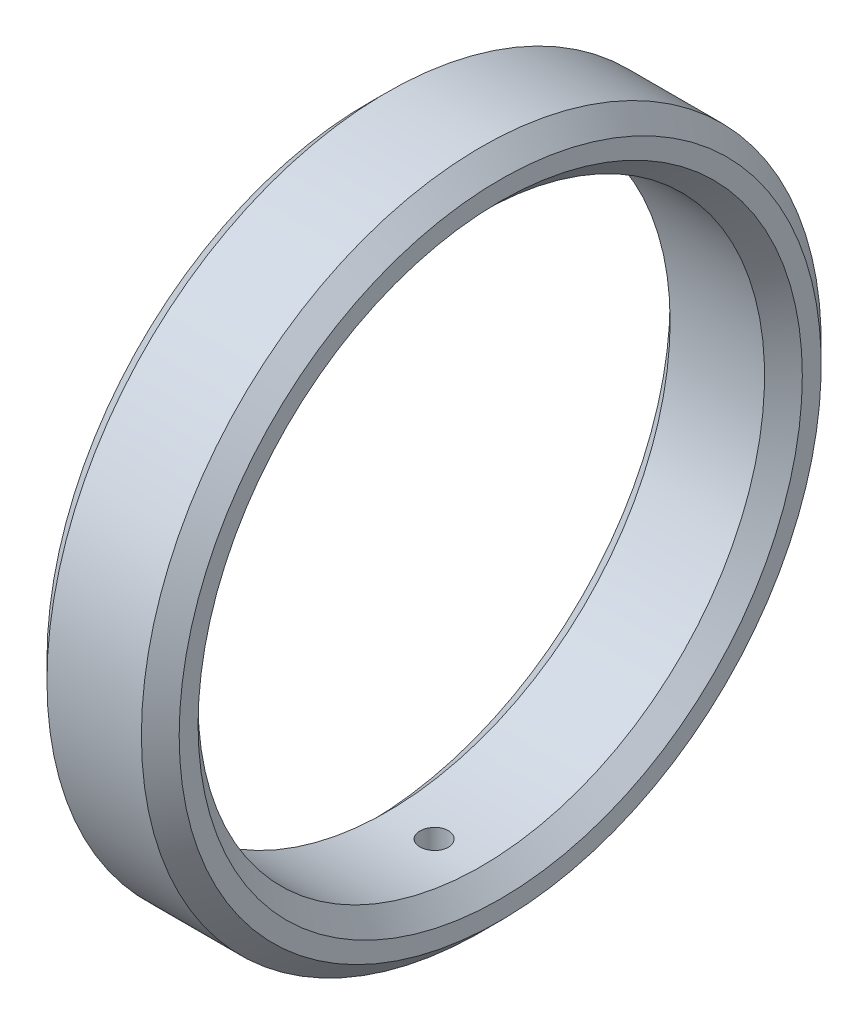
ISO-10303-21;
HEADER;
FILE_DESCRIPTION(('STEP AP214'),'2;1');
FILE_NAME('part.step','',(''),(''),'','','');
FILE_SCHEMA(('AUTOMOTIVE_DESIGN { 1 0 10303 214 1 1 1 1 }'));
ENDSEC;
DATA;
#1=APPLICATION_CONTEXT('core data for automotive mechanical design processes');
#2=APPLICATION_PROTOCOL_DEFINITION('international standard','automotive_design',2000,#1);
#3=PRODUCT_CONTEXT('',#1,'mechanical');
#4=PRODUCT('Part','Part','',(#3));
#5=PRODUCT_RELATED_PRODUCT_CATEGORY('part','',(#4));
#6=PRODUCT_DEFINITION_FORMATION('','',#4);
#7=PRODUCT_DEFINITION_CONTEXT('part definition',#1,'design');
#8=PRODUCT_DEFINITION('design','',#6,#7);
#9=PRODUCT_DEFINITION_SHAPE('','',#8);
#10=(LENGTH_UNIT() NAMED_UNIT(*) SI_UNIT(.MILLI.,.METRE.));
#11=(NAMED_UNIT(*) PLANE_ANGLE_UNIT() SI_UNIT($,.RADIAN.));
#12=(NAMED_UNIT(*) SI_UNIT($,.STERADIAN.) SOLID_ANGLE_UNIT());
#13=UNCERTAINTY_MEASURE_WITH_UNIT(LENGTH_MEASURE(1.E-05),#10,'distance_accuracy_value','');
#14=(GEOMETRIC_REPRESENTATION_CONTEXT(3) GLOBAL_UNCERTAINTY_ASSIGNED_CONTEXT((#13)) GLOBAL_UNIT_ASSIGNED_CONTEXT((#10,
#11,#12)) REPRESENTATION_CONTEXT('',''));
#15=CARTESIAN_POINT('',(0.,0.,0.));
#16=DIRECTION('',(0.,0.,1.));
#17=DIRECTION('',(1.,0.,0.));
#18=AXIS2_PLACEMENT_3D('',#15,#16,#17);
#19=CARTESIAN_POINT('',(-17.9946864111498,0.,0.));
#20=DIRECTION('',(1.,0.,0.));
#21=DIRECTION('',(0.,0.,-1.));
#22=AXIS2_PLACEMENT_3D('',#19,#20,#21);
#23=CONICAL_SURFACE('',#22,18.,0.785398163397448);
#24=CARTESIAN_POINT('',(-18.9946864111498,0.,0.));
#25=DIRECTION('',(-1.,0.,0.));
#26=DIRECTION('',(0.,0.,1.));
#27=AXIS2_PLACEMENT_3D('',#24,#25,#26);
#28=CIRCLE('',#27,17.);
#29=CARTESIAN_POINT('',(-18.9946864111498,0.,17.));
#30=VERTEX_POINT('',#29);
#31=EDGE_CURVE('E66',#30,#30,#28,.T.);
#32=ORIENTED_EDGE('',*,*,#31,.F.);
#33=EDGE_LOOP('',(#32));
#34=FACE_BOUND('',#33,.T.);
#35=CARTESIAN_POINT('',(-17.9946864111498,0.,0.));
#36=DIRECTION('',(-1.,0.,0.));
#37=DIRECTION('',(0.,0.,1.));
#38=AXIS2_PLACEMENT_3D('',#35,#36,#37);
#39=CIRCLE('',#38,18.);
#40=CARTESIAN_POINT('',(-17.9946864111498,0.,18.));
#41=VERTEX_POINT('',#40);
#42=EDGE_CURVE('E57',#41,#41,#39,.T.);
#43=ORIENTED_EDGE('',*,*,#42,.T.);
#44=EDGE_LOOP('',(#43));
#45=FACE_BOUND('',#44,.T.);
#46=ADVANCED_FACE('F33',(#34,#45),#23,.T.);
#47=CARTESIAN_POINT('',(-47.2046167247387,0.,0.));
#48=DIRECTION('',(-1.,0.,0.));
#49=DIRECTION('',(0.,0.,1.));
#50=AXIS2_PLACEMENT_3D('',#47,#48,#49);
#51=CYLINDRICAL_SURFACE('',#50,18.);
#52=CARTESIAN_POINT('',(-15.4946864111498,-17.9843682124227,0.75));
#53=CARTESIAN_POINT('',(-15.452578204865,-17.9843684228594,0.749998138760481));
#54=CARTESIAN_POINT('',(-15.4104399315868,-17.9845176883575,0.746441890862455));
#55=CARTESIAN_POINT('',(-15.3273252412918,-17.9850987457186,0.732305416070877));
#56=CARTESIAN_POINT('',(-15.286350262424,-17.9855308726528,0.721716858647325));
#57=CARTESIAN_POINT('',(-15.206778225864,-17.986628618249,0.69381892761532));
#58=CARTESIAN_POINT('',(-15.1681799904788,-17.9872941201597,0.67651291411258));
#59=CARTESIAN_POINT('',(-15.0944470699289,-17.9887834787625,0.635676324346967));
#60=CARTESIAN_POINT('',(-15.0593115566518,-17.9896072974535,0.612147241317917));
#61=CARTESIAN_POINT('',(-14.9934645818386,-17.9913211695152,0.559512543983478));
#62=CARTESIAN_POINT('',(-14.9627559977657,-17.9922112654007,0.530403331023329));
#63=CARTESIAN_POINT('',(-14.9066590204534,-17.9939569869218,0.467441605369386));
#64=CARTESIAN_POINT('',(-14.8812708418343,-17.9948126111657,0.433588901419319));
#65=CARTESIAN_POINT('',(-14.8365284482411,-17.9963932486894,0.362087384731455));
#66=CARTESIAN_POINT('',(-14.8171763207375,-17.9971182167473,0.32443726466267));
#67=CARTESIAN_POINT('',(-14.785068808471,-17.9983554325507,0.246418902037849));
#68=CARTESIAN_POINT('',(-14.772313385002,-17.9988676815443,0.206050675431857));
#69=CARTESIAN_POINT('',(-14.7537685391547,-17.9996214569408,0.123767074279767));
#70=CARTESIAN_POINT('',(-14.7479750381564,-17.9998631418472,0.0818526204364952));
#71=CARTESIAN_POINT('',(-14.7435059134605,-18.0000490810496,-0.00235454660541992));
#72=CARTESIAN_POINT('',(-14.7448302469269,-17.9999933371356,-0.0446472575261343));
#73=CARTESIAN_POINT('',(-14.7545557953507,-17.9995908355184,-0.128382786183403));
#74=CARTESIAN_POINT('',(-14.7629526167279,-17.9992442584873,-0.169826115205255));
#75=CARTESIAN_POINT('',(-14.7865779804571,-17.9982993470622,-0.25071444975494));
#76=CARTESIAN_POINT('',(-14.8018065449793,-17.9977010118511,-0.290159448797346));
#77=CARTESIAN_POINT('',(-14.8386681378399,-17.9963196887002,-0.36594558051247));
#78=CARTESIAN_POINT('',(-14.8603031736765,-17.995536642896,-0.402285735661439));
#79=CARTESIAN_POINT('',(-14.9093620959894,-17.99387411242,-0.470819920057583));
#80=CARTESIAN_POINT('',(-14.9367860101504,-17.992994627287,-0.503013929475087));
#81=CARTESIAN_POINT('',(-14.9966690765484,-17.991237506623,-0.562367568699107));
#82=CARTESIAN_POINT('',(-15.0291320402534,-17.990359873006,-0.589523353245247));
#83=CARTESIAN_POINT('',(-15.0981582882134,-17.988706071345,-0.638000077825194));
#84=CARTESIAN_POINT('',(-15.1347215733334,-17.9879299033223,-0.659321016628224));
#85=CARTESIAN_POINT('',(-15.2109128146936,-17.9865666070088,-0.695522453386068));
#86=CARTESIAN_POINT('',(-15.2505408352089,-17.985979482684,-0.710402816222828));
#87=CARTESIAN_POINT('',(-15.3317356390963,-17.9850606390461,-0.733298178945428));
#88=CARTESIAN_POINT('',(-15.373302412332,-17.984728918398,-0.741313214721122));
#89=CARTESIAN_POINT('',(-15.4571613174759,-17.9843585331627,-0.750245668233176));
#90=CARTESIAN_POINT('',(-15.499452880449,-17.9843196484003,-0.751168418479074));
#91=CARTESIAN_POINT('',(-15.5835902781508,-17.9845387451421,-0.745904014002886));
#92=CARTESIAN_POINT('',(-15.6254361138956,-17.9847967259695,-0.739716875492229));
#93=CARTESIAN_POINT('',(-15.707479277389,-17.9855802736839,-0.72041274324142));
#94=CARTESIAN_POINT('',(-15.7476771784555,-17.9861057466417,-0.707298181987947));
#95=CARTESIAN_POINT('',(-15.8253010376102,-17.9873649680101,-0.674513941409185));
#96=CARTESIAN_POINT('',(-15.8627269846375,-17.9880987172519,-0.654844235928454));
#97=CARTESIAN_POINT('',(-15.9337690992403,-17.9896923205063,-0.609494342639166));
#98=CARTESIAN_POINT('',(-15.9673829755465,-17.9905522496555,-0.583810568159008));
#99=CARTESIAN_POINT('',(-16.0298237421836,-17.9923010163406,-0.52716685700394));
#100=CARTESIAN_POINT('',(-16.0586506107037,-17.9931898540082,-0.496206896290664));
#101=CARTESIAN_POINT('',(-16.1107169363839,-17.9948968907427,-0.42986677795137));
#102=CARTESIAN_POINT('',(-16.133952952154,-17.9957150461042,-0.394483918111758));
#103=CARTESIAN_POINT('',(-16.1741544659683,-17.9971878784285,-0.320316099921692));
#104=CARTESIAN_POINT('',(-16.1911199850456,-17.9978425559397,-0.281531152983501));
#105=CARTESIAN_POINT('',(-16.2182928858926,-17.998914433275,-0.201673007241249));
#106=CARTESIAN_POINT('',(-16.2285024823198,-17.9993317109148,-0.160600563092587));
#107=CARTESIAN_POINT('',(-16.2418809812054,-17.9998820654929,-0.077322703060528));
#108=CARTESIAN_POINT('',(-16.2450499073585,-18.0000151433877,-0.0351172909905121));
#109=CARTESIAN_POINT('',(-16.2442568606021,-17.9999821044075,0.0491942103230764));
#110=CARTESIAN_POINT('',(-16.2403002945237,-17.9998162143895,0.0913003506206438));
#111=CARTESIAN_POINT('',(-16.2253797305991,-17.9992043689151,0.174250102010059));
#112=CARTESIAN_POINT('',(-16.2144157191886,-17.9987584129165,0.215093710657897));
#113=CARTESIAN_POINT('',(-16.1857924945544,-17.9976366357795,0.294360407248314));
#114=CARTESIAN_POINT('',(-16.1681331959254,-17.9969608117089,0.332783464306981));
#115=CARTESIAN_POINT('',(-16.1266218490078,-17.9954553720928,0.40611927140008));
#116=CARTESIAN_POINT('',(-16.1027700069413,-17.9946257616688,0.441032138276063));
#117=CARTESIAN_POINT('',(-16.0495321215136,-17.9929054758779,0.506382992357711));
#118=CARTESIAN_POINT('',(-16.0201424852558,-17.9920147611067,0.536818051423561));
#119=CARTESIAN_POINT('',(-15.9566623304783,-17.9902728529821,0.59233121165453));
#120=CARTESIAN_POINT('',(-15.9225706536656,-17.9894216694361,0.617407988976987));
#121=CARTESIAN_POINT('',(-15.8506338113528,-17.9878543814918,0.661500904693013));
#122=CARTESIAN_POINT('',(-15.812785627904,-17.9871383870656,0.680512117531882));
#123=CARTESIAN_POINT('',(-15.734460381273,-17.985924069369,0.711887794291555));
#124=CARTESIAN_POINT('',(-15.6939865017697,-17.9854254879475,0.724260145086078));
#125=CARTESIAN_POINT('',(-15.6268303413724,-17.9848348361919,0.738745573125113));
#126=CARTESIAN_POINT('',(-15.6005834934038,-17.9846606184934,0.742960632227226));
#127=CARTESIAN_POINT('',(-15.5477905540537,-17.9844272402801,0.748588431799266));
#128=CARTESIAN_POINT('',(-15.5212444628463,-17.9843680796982,0.75000117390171));
#129=CARTESIAN_POINT('',(-15.4946864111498,-17.9843682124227,0.75));
#130=B_SPLINE_CURVE_WITH_KNOTS('',3,(#52,#53,#54,#55,#56,#57,#58,#59,#60,#61,#62,#63,#64,#65,
#66,#67,#68,#69,#70,#71,#72,#73,#74,#75,#76,#77,#78,#79,#80,#81,#82,#83,#84,#85,#86,#87,#88,#89,
#90,#91,#92,#93,#94,#95,#96,#97,#98,#99,#100,#101,#102,#103,#104,#105,#106,#107,#108,#109,#110,
#111,#112,#113,#114,#115,#116,#117,#118,#119,#120,#121,#122,#123,#124,#125,#126,#127,#128,#129),
.UNSPECIFIED.,.T.,.F.,(4,2,2,2,2,2,2,2,2,2,2,2,2,2,2,2,2,2,2,2,2,2,2,2,2,2,2,2,2,2,2,2,2,2,2,2,
2,2,4),(0.,0.126227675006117,0.252605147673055,0.378919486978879,0.505203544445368,
0.631569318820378,0.75794018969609,0.884354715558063,1.01076849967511,1.13710818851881,
1.26344711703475,1.38970761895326,1.51596853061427,1.64226904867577,1.76857017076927,
1.89496729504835,2.02136444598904,2.14776424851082,2.27416339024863,2.40046748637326,
2.52677129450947,2.65303078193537,2.77929077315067,2.90562625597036,3.03196231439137,
3.15837593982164,3.28478914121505,3.41116088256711,3.53753219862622,3.66380766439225,
3.79008337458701,3.91636069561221,4.04263381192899,4.16898913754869,4.29537564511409,
4.42186452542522,4.54820280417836,4.62781586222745,4.70742887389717),.UNSPECIFIED.);
#131=CARTESIAN_POINT('',(-15.4946864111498,-17.9843682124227,0.75));
#132=VERTEX_POINT('',#131);
#133=EDGE_CURVE('E69',#132,#132,#130,.T.);
#134=ORIENTED_EDGE('',*,*,#133,.T.);
#135=EDGE_LOOP('',(#134));
#136=FACE_BOUND('',#135,.T.);
#137=ORIENTED_EDGE('',*,*,#42,.F.);
#138=EDGE_LOOP('',(#137));
#139=FACE_BOUND('',#138,.T.);
#140=CARTESIAN_POINT('',(-12.9946864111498,0.,0.));
#141=DIRECTION('',(-1.,0.,0.));
#142=DIRECTION('',(0.,0.,1.));
#143=AXIS2_PLACEMENT_3D('',#140,#141,#142);
#144=CIRCLE('',#143,18.);
#145=CARTESIAN_POINT('',(-12.9946864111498,0.,18.));
#146=VERTEX_POINT('',#145);
#147=EDGE_CURVE('E60',#146,#146,#144,.T.);
#148=ORIENTED_EDGE('',*,*,#147,.T.);
#149=EDGE_LOOP('',(#148));
#150=FACE_BOUND('',#149,.T.);
#151=ADVANCED_FACE('F74',(#136,#139,#150),#51,.T.);
#152=CARTESIAN_POINT('',(-11.9946864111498,0.,0.));
#153=DIRECTION('',(-1.,0.,0.));
#154=DIRECTION('',(0.,0.,1.));
#155=AXIS2_PLACEMENT_3D('',#152,#153,#154);
#156=CONICAL_SURFACE('',#155,17.,0.785398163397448);
#157=ORIENTED_EDGE('',*,*,#147,.F.);
#158=EDGE_LOOP('',(#157));
#159=FACE_BOUND('',#158,.T.);
#160=CARTESIAN_POINT('',(-11.9946864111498,0.,0.));
#161=DIRECTION('',(-1.,0.,0.));
#162=DIRECTION('',(0.,0.,1.));
#163=AXIS2_PLACEMENT_3D('',#160,#161,#162);
#164=CIRCLE('',#163,17.);
#165=CARTESIAN_POINT('',(-11.9946864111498,0.,17.));
#166=VERTEX_POINT('',#165);
#167=EDGE_CURVE('E63',#166,#166,#164,.T.);
#168=ORIENTED_EDGE('',*,*,#167,.T.);
#169=EDGE_LOOP('',(#168));
#170=FACE_BOUND('',#169,.T.);
#171=ADVANCED_FACE('F101',(#159,#170),#156,.T.);
#172=CARTESIAN_POINT('',(-11.9946864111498,17.,0.));
#173=DIRECTION('',(-1.,0.,0.));
#174=DIRECTION('',(0.,0.,1.));
#175=AXIS2_PLACEMENT_3D('',#172,#173,#174);
#176=PLANE('',#175);
#177=CARTESIAN_POINT('',(-11.9946864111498,0.,0.));
#178=DIRECTION('',(-1.,0.,0.));
#179=DIRECTION('',(0.,0.,1.));
#180=AXIS2_PLACEMENT_3D('',#177,#178,#179);
#181=CIRCLE('',#180,16.);
#182=CARTESIAN_POINT('',(-11.9946864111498,0.,16.));
#183=VERTEX_POINT('',#182);
#184=EDGE_CURVE('E10',#183,#183,#181,.T.);
#185=ORIENTED_EDGE('',*,*,#184,.T.);
#186=EDGE_LOOP('',(#185));
#187=FACE_BOUND('',#186,.T.);
#188=ORIENTED_EDGE('',*,*,#167,.F.);
#189=EDGE_LOOP('',(#188));
#190=FACE_BOUND('',#189,.T.);
#191=ADVANCED_FACE('F98',(#187,#190),#176,.F.);
#192=CARTESIAN_POINT('',(-18.9946864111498,17.,0.));
#193=DIRECTION('',(1.,0.,0.));
#194=DIRECTION('',(0.,0.,-1.));
#195=AXIS2_PLACEMENT_3D('',#192,#193,#194);
#196=PLANE('',#195);
#197=CARTESIAN_POINT('',(-18.9946864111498,0.,0.));
#198=DIRECTION('',(1.,0.,0.));
#199=DIRECTION('',(0.,0.,-1.));
#200=AXIS2_PLACEMENT_3D('',#197,#198,#199);
#201=CIRCLE('',#200,16.);
#202=CARTESIAN_POINT('',(-18.9946864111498,0.,-16.));
#203=VERTEX_POINT('',#202);
#204=EDGE_CURVE('E45',#203,#203,#201,.T.);
#205=ORIENTED_EDGE('',*,*,#204,.T.);
#206=EDGE_LOOP('',(#205));
#207=FACE_BOUND('',#206,.T.);
#208=ORIENTED_EDGE('',*,*,#31,.T.);
#209=EDGE_LOOP('',(#208));
#210=FACE_BOUND('',#209,.T.);
#211=ADVANCED_FACE('F94',(#207,#210),#196,.F.);
#212=CARTESIAN_POINT('',(-11.9946864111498,0.,0.));
#213=DIRECTION('',(-1.,0.,0.));
#214=DIRECTION('',(0.,0.,1.));
#215=AXIS2_PLACEMENT_3D('',#212,#213,#214);
#216=CYLINDRICAL_SURFACE('',#215,15.);
#217=CARTESIAN_POINT('',(-15.4946864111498,-14.9812382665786,0.75));
#218=CARTESIAN_POINT('',(-15.5367859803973,-14.9812385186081,0.749998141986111));
#219=CARTESIAN_POINT('',(-15.578915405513,-14.981417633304,0.746443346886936));
#220=CARTESIAN_POINT('',(-15.6620120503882,-14.9821148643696,0.732312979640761));
#221=CARTESIAN_POINT('',(-15.7029778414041,-14.9826333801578,0.721729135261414));
#222=CARTESIAN_POINT('',(-15.7825314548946,-14.9839505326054,0.693844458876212));
#223=CARTESIAN_POINT('',(-15.8211204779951,-14.9847490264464,0.676547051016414));
#224=CARTESIAN_POINT('',(-15.8948367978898,-14.9865359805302,0.6357315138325));
#225=CARTESIAN_POINT('',(-15.9299649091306,-14.987524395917,0.612214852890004));
#226=CARTESIAN_POINT('',(-15.9958082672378,-14.9895809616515,0.559601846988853));
#227=CARTESIAN_POINT('',(-16.0265195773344,-14.9906491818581,0.530500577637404));
#228=CARTESIAN_POINT('',(-16.0826239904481,-14.9927443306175,0.467554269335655));
#229=CARTESIAN_POINT('',(-16.1080168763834,-14.9937712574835,0.433709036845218));
#230=CARTESIAN_POINT('',(-16.1527744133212,-14.9956686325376,0.362215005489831));
#231=CARTESIAN_POINT('',(-16.1721360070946,-14.9965390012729,0.324564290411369));
#232=CARTESIAN_POINT('',(-16.2042617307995,-14.9980244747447,0.246541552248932));
#233=CARTESIAN_POINT('',(-16.2170259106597,-14.9986395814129,0.206169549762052));
#234=CARTESIAN_POINT('',(-16.2355841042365,-14.9995447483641,0.123886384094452));
#235=CARTESIAN_POINT('',(-16.2413839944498,-14.9998350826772,0.0819765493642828));
#236=CARTESIAN_POINT('',(-16.2458671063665,-15.0000589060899,-0.00222278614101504));
#237=CARTESIAN_POINT('',(-16.2445503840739,-14.9999923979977,-0.0445122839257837));
#238=CARTESIAN_POINT('',(-16.2348425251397,-14.9995102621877,-0.12823071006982));
#239=CARTESIAN_POINT('',(-16.2264577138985,-14.9990949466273,-0.169660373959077));
#240=CARTESIAN_POINT('',(-16.2028614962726,-14.9979623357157,-0.250523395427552));
#241=CARTESIAN_POINT('',(-16.1876500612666,-14.9972450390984,-0.289956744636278));
#242=CARTESIAN_POINT('',(-16.1508251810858,-14.9955887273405,-0.365728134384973));
#243=CARTESIAN_POINT('',(-16.1292088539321,-14.9946496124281,-0.402064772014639));
#244=CARTESIAN_POINT('',(-16.080189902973,-14.9926554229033,-0.470595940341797));
#245=CARTESIAN_POINT('',(-16.0527872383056,-14.9916003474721,-0.502790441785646));
#246=CARTESIAN_POINT('',(-15.9929377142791,-14.9894916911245,-0.562160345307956));
#247=CARTESIAN_POINT('',(-15.9604853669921,-14.9884381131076,-0.589330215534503));
#248=CARTESIAN_POINT('',(-15.8914769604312,-14.9864523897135,-0.637836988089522));
#249=CARTESIAN_POINT('',(-15.8549209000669,-14.9855202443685,-0.659173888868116));
#250=CARTESIAN_POINT('',(-15.778739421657,-14.983882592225,-0.695408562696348));
#251=CARTESIAN_POINT('',(-15.7391139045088,-14.983177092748,-0.710306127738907));
#252=CARTESIAN_POINT('',(-15.6579198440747,-14.9820725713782,-0.733235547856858));
#253=CARTESIAN_POINT('',(-15.6163513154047,-14.9816735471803,-0.741267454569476));
#254=CARTESIAN_POINT('',(-15.5324993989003,-14.9812274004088,-0.750230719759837));
#255=CARTESIAN_POINT('',(-15.4902168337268,-14.9811798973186,-0.75116975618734));
#256=CARTESIAN_POINT('',(-15.4060947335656,-14.9814411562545,-0.745940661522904));
#257=CARTESIAN_POINT('',(-15.3642551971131,-14.9817499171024,-0.739772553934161));
#258=CARTESIAN_POINT('',(-15.2822283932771,-14.9826885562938,-0.720510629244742));
#259=CARTESIAN_POINT('',(-15.2420402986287,-14.9833182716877,-0.707420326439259));
#260=CARTESIAN_POINT('',(-15.1644316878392,-14.9848277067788,-0.674689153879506));
#261=CARTESIAN_POINT('',(-15.1270111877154,-14.9857074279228,-0.655048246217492));
#262=CARTESIAN_POINT('',(-15.0559646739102,-14.987618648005,-0.609753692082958));
#263=CARTESIAN_POINT('',(-15.0223419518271,-14.9886502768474,-0.58409488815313));
#264=CARTESIAN_POINT('',(-14.9598785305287,-14.990748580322,-0.527500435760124));
#265=CARTESIAN_POINT('',(-14.9310378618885,-14.9918152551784,-0.496564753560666));
#266=CARTESIAN_POINT('',(-14.8789314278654,-14.9938645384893,-0.430261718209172));
#267=CARTESIAN_POINT('',(-14.8556706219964,-14.9948470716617,-0.394890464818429));
#268=CARTESIAN_POINT('',(-14.8154181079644,-14.9966162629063,-0.3207400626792));
#269=CARTESIAN_POINT('',(-14.7984263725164,-14.997402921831,-0.281960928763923));
#270=CARTESIAN_POINT('',(-14.7712030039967,-14.9986913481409,-0.202114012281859));
#271=CARTESIAN_POINT('',(-14.7609681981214,-14.9991932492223,-0.161047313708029));
#272=CARTESIAN_POINT('',(-14.7475388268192,-14.9998561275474,-0.0777758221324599));
#273=CARTESIAN_POINT('',(-14.7443442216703,-15.0000171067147,-0.0355710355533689));
#274=CARTESIAN_POINT('',(-14.7450863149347,-14.9999800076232,0.0487293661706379));
#275=CARTESIAN_POINT('',(-14.7490152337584,-14.9997823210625,0.0908250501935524));
#276=CARTESIAN_POINT('',(-14.7638767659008,-14.999050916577,0.173758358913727));
#277=CARTESIAN_POINT('',(-14.7748093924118,-14.9985171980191,0.214595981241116));
#278=CARTESIAN_POINT('',(-14.8033664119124,-14.9971737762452,0.293855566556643));
#279=CARTESIAN_POINT('',(-14.8209908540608,-14.9963640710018,0.332277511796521));
#280=CARTESIAN_POINT('',(-14.8624298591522,-14.9945597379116,0.40561752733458));
#281=CARTESIAN_POINT('',(-14.886244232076,-14.9935651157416,0.440535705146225));
#282=CARTESIAN_POINT('',(-14.939414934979,-14.9915016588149,0.505915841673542));
#283=CARTESIAN_POINT('',(-14.9687766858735,-14.9904327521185,0.536373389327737));
#284=CARTESIAN_POINT('',(-15.0322051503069,-14.9883416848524,0.591936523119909));
#285=CARTESIAN_POINT('',(-15.0662730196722,-14.9873195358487,0.617040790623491));
#286=CARTESIAN_POINT('',(-15.1381734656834,-14.9854365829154,0.661196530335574));
#287=CARTESIAN_POINT('',(-15.1760096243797,-14.9845759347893,0.680242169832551));
#288=CARTESIAN_POINT('',(-15.2543185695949,-14.9831155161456,0.711687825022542));
#289=CARTESIAN_POINT('',(-15.2947881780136,-14.9825154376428,0.724095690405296));
#290=CARTESIAN_POINT('',(-15.3620387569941,-14.9818027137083,0.73865896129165));
#291=CARTESIAN_POINT('',(-15.3883841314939,-14.9815919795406,0.742906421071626));
#292=CARTESIAN_POINT('',(-15.4413778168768,-14.9813096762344,0.748577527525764));
#293=CARTESIAN_POINT('',(-15.4680261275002,-14.9812381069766,0.750001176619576));
#294=CARTESIAN_POINT('',(-15.4946864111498,-14.9812382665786,0.75));
#295=B_SPLINE_CURVE_WITH_KNOTS('',3,(#217,#218,#219,#220,#221,#222,#223,#224,#225,#226,#227,
#228,#229,#230,#231,#232,#233,#234,#235,#236,#237,#238,#239,#240,#241,#242,#243,#244,#245,#246,
#247,#248,#249,#250,#251,#252,#253,#254,#255,#256,#257,#258,#259,#260,#261,#262,#263,#264,#265,
#266,#267,#268,#269,#270,#271,#272,#273,#274,#275,#276,#277,#278,#279,#280,#281,#282,#283,#284,
#285,#286,#287,#288,#289,#290,#291,#292,#293,#294),.UNSPECIFIED.,.T.,.F.,(4,2,2,2,2,2,2,2,2,2,2,
2,2,2,2,2,2,2,2,2,2,2,2,2,2,2,2,2,2,2,2,2,2,2,2,2,2,2,4),(0.,0.126201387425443,
0.252551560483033,0.378837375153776,0.505093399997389,0.631461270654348,0.7578342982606,
0.884271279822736,1.01070730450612,1.13703656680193,1.26336483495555,1.38958016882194,
1.51579603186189,1.64206877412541,1.76834240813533,1.89475424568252,2.02116611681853,
2.14758207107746,2.2739970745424,2.40027521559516,2.52655293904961,2.65276661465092,
2.77898102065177,2.90530399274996,3.03162777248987,3.1580634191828,3.28449851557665,
3.41087420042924,3.53724917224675,3.66348621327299,3.78972349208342,3.91596169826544,
4.0421960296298,4.16855436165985,4.294943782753,4.42145451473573,4.54781530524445,
4.6277345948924,4.7076538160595),.UNSPECIFIED.);
#296=CARTESIAN_POINT('',(-15.4946864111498,-14.9812382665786,0.75));
#297=VERTEX_POINT('',#296);
#298=EDGE_CURVE('E36',#297,#297,#295,.T.);
#299=ORIENTED_EDGE('',*,*,#298,.T.);
#300=EDGE_LOOP('',(#299));
#301=FACE_BOUND('',#300,.T.);
#302=CARTESIAN_POINT('',(-17.9946864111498,0.,0.));
#303=DIRECTION('',(1.,0.,0.));
#304=DIRECTION('',(0.,0.,-1.));
#305=AXIS2_PLACEMENT_3D('',#302,#303,#304);
#306=CIRCLE('',#305,15.);
#307=CARTESIAN_POINT('',(-17.9946864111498,0.,-15.));
#308=VERTEX_POINT('',#307);
#309=EDGE_CURVE('E49',#308,#308,#306,.F.);
#310=ORIENTED_EDGE('',*,*,#309,.T.);
#311=EDGE_LOOP('',(#310));
#312=FACE_BOUND('',#311,.T.);
#313=CARTESIAN_POINT('',(-12.9946864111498,0.,0.));
#314=DIRECTION('',(-1.,0.,0.));
#315=DIRECTION('',(0.,0.,1.));
#316=AXIS2_PLACEMENT_3D('',#313,#314,#315);
#317=CIRCLE('',#316,15.);
#318=CARTESIAN_POINT('',(-12.9946864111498,0.,15.));
#319=VERTEX_POINT('',#318);
#320=EDGE_CURVE('E54',#319,#319,#317,.F.);
#321=ORIENTED_EDGE('',*,*,#320,.T.);
#322=EDGE_LOOP('',(#321));
#323=FACE_BOUND('',#322,.T.);
#324=ADVANCED_FACE('F89',(#301,#312,#323),#216,.F.);
#325=CARTESIAN_POINT('',(-17.9946864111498,0.,0.));
#326=DIRECTION('',(-1.,0.,0.));
#327=DIRECTION('',(0.,0.,1.));
#328=AXIS2_PLACEMENT_3D('',#325,#326,#327);
#329=CONICAL_SURFACE('',#328,15.,0.785398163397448);
#330=ORIENTED_EDGE('',*,*,#204,.F.);
#331=EDGE_LOOP('',(#330));
#332=FACE_BOUND('',#331,.T.);
#333=ORIENTED_EDGE('',*,*,#309,.F.);
#334=EDGE_LOOP('',(#333));
#335=FACE_BOUND('',#334,.T.);
#336=ADVANCED_FACE('F86',(#332,#335),#329,.F.);
#337=CARTESIAN_POINT('',(-11.9946864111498,0.,0.));
#338=DIRECTION('',(1.,0.,0.));
#339=DIRECTION('',(0.,0.,-1.));
#340=AXIS2_PLACEMENT_3D('',#337,#338,#339);
#341=CONICAL_SURFACE('',#340,16.,0.785398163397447);
#342=ORIENTED_EDGE('',*,*,#320,.F.);
#343=EDGE_LOOP('',(#342));
#344=FACE_BOUND('',#343,.T.);
#345=ORIENTED_EDGE('',*,*,#184,.F.);
#346=EDGE_LOOP('',(#345));
#347=FACE_BOUND('',#346,.T.);
#348=ADVANCED_FACE('F81',(#344,#347),#341,.F.);
#349=CARTESIAN_POINT('',(-15.4946864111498,-20.,0.));
#350=DIRECTION('',(0.,1.,0.));
#351=DIRECTION('',(0.,0.,1.));
#352=AXIS2_PLACEMENT_3D('',#349,#350,#351);
#353=CYLINDRICAL_SURFACE('',#352,0.75);
#354=ORIENTED_EDGE('',*,*,#298,.F.);
#355=EDGE_LOOP('',(#354));
#356=FACE_BOUND('',#355,.T.);
#357=ORIENTED_EDGE('',*,*,#133,.F.);
#358=EDGE_LOOP('',(#357));
#359=FACE_BOUND('',#358,.T.);
#360=ADVANCED_FACE('F77',(#356,#359),#353,.F.);
#361=CLOSED_SHELL('',(#46,#151,#171,#191,#211,#324,#336,#348,#360));
#362=MANIFOLD_SOLID_BREP('B2',#361);
#363=ADVANCED_BREP_SHAPE_REPRESENTATION('',(#18,#362),#14);
#364=SHAPE_DEFINITION_REPRESENTATION(#9,#363);
ENDSEC;
END-ISO-10303-21;
